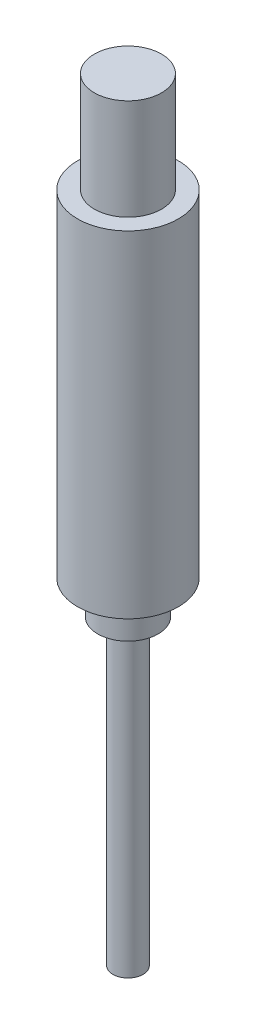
ISO-10303-21;
HEADER;
FILE_DESCRIPTION(('STEP AP214'),'2;1');
FILE_NAME('part.step','',(''),(''),'','','');
FILE_SCHEMA(('AUTOMOTIVE_DESIGN { 1 0 10303 214 1 1 1 1 }'));
ENDSEC;
DATA;
#1=APPLICATION_CONTEXT('core data for automotive mechanical design processes');
#2=APPLICATION_PROTOCOL_DEFINITION('international standard','automotive_design',2000,#1);
#3=PRODUCT_CONTEXT('',#1,'mechanical');
#4=PRODUCT('Part','Part','',(#3));
#5=PRODUCT_RELATED_PRODUCT_CATEGORY('part','',(#4));
#6=PRODUCT_DEFINITION_FORMATION('','',#4);
#7=PRODUCT_DEFINITION_CONTEXT('part definition',#1,'design');
#8=PRODUCT_DEFINITION('design','',#6,#7);
#9=PRODUCT_DEFINITION_SHAPE('','',#8);
#10=(LENGTH_UNIT() NAMED_UNIT(*) SI_UNIT(.MILLI.,.METRE.));
#11=(NAMED_UNIT(*) PLANE_ANGLE_UNIT() SI_UNIT($,.RADIAN.));
#12=(NAMED_UNIT(*) SI_UNIT($,.STERADIAN.) SOLID_ANGLE_UNIT());
#13=UNCERTAINTY_MEASURE_WITH_UNIT(LENGTH_MEASURE(1.E-05),#10,'distance_accuracy_value','');
#14=(GEOMETRIC_REPRESENTATION_CONTEXT(3) GLOBAL_UNCERTAINTY_ASSIGNED_CONTEXT((#13)) GLOBAL_UNIT_ASSIGNED_CONTEXT((#10,
#11,#12)) REPRESENTATION_CONTEXT('',''));
#15=CARTESIAN_POINT('',(0.,0.,0.));
#16=DIRECTION('',(0.,0.,1.));
#17=DIRECTION('',(1.,0.,0.));
#18=AXIS2_PLACEMENT_3D('',#15,#16,#17);
#19=CARTESIAN_POINT('',(-30.8921980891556,10.,-14.4906702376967));
#20=DIRECTION('',(0.,1.,0.));
#21=DIRECTION('',(0.,0.,1.));
#22=AXIS2_PLACEMENT_3D('',#19,#20,#21);
#23=PLANE('',#22);
#24=CARTESIAN_POINT('',(-30.8921980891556,10.,-14.4906702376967));
#25=DIRECTION('',(0.,1.,0.));
#26=DIRECTION('',(0.,0.,1.));
#27=AXIS2_PLACEMENT_3D('',#24,#25,#26);
#28=CIRCLE('',#27,1.5);
#29=CARTESIAN_POINT('',(-30.8921980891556,10.,-12.9906702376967));
#30=VERTEX_POINT('',#29);
#31=EDGE_CURVE('E29',#30,#30,#28,.T.);
#32=ORIENTED_EDGE('',*,*,#31,.F.);
#33=EDGE_LOOP('',(#32));
#34=FACE_BOUND('',#33,.T.);
#35=CARTESIAN_POINT('',(-30.8921980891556,10.,-14.4906702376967));
#36=DIRECTION('',(0.,1.,0.));
#37=DIRECTION('',(0.,0.,1.));
#38=AXIS2_PLACEMENT_3D('',#35,#36,#37);
#39=CIRCLE('',#38,0.9);
#40=CARTESIAN_POINT('',(-30.8921980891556,10.,-13.5906702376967));
#41=VERTEX_POINT('',#40);
#42=EDGE_CURVE('E10',#41,#41,#39,.F.);
#43=ORIENTED_EDGE('',*,*,#42,.F.);
#44=EDGE_LOOP('',(#43));
#45=FACE_BOUND('',#44,.T.);
#46=ADVANCED_FACE('F14',(#34,#45),#23,.F.);
#47=CARTESIAN_POINT('',(-30.8921980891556,20.,-14.4906702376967));
#48=DIRECTION('',(0.,1.,0.));
#49=DIRECTION('',(0.,0.,1.));
#50=AXIS2_PLACEMENT_3D('',#47,#48,#49);
#51=PLANE('',#50);
#52=CARTESIAN_POINT('',(-30.8921980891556,20.,-14.4906702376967));
#53=DIRECTION('',(0.,1.,0.));
#54=DIRECTION('',(0.,0.,1.));
#55=AXIS2_PLACEMENT_3D('',#52,#53,#54);
#56=CIRCLE('',#55,1.5);
#57=CARTESIAN_POINT('',(-30.8921980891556,20.,-12.9906702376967));
#58=VERTEX_POINT('',#57);
#59=EDGE_CURVE('E26',#58,#58,#56,.T.);
#60=ORIENTED_EDGE('',*,*,#59,.T.);
#61=EDGE_LOOP('',(#60));
#62=FACE_BOUND('',#61,.T.);
#63=CARTESIAN_POINT('',(-30.8921980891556,20.,-14.4906702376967));
#64=DIRECTION('',(0.,1.,0.));
#65=DIRECTION('',(0.,0.,1.));
#66=AXIS2_PLACEMENT_3D('',#63,#64,#65);
#67=CIRCLE('',#66,1.);
#68=CARTESIAN_POINT('',(-30.8921980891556,20.,-13.4906702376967));
#69=VERTEX_POINT('',#68);
#70=EDGE_CURVE('E35',#69,#69,#67,.T.);
#71=ORIENTED_EDGE('',*,*,#70,.F.);
#72=EDGE_LOOP('',(#71));
#73=FACE_BOUND('',#72,.T.);
#74=ADVANCED_FACE('F67',(#62,#73),#51,.T.);
#75=CARTESIAN_POINT('',(-30.8921980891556,20.,-14.4906702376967));
#76=DIRECTION('',(0.,-1.,0.));
#77=DIRECTION('',(0.,0.,-1.));
#78=AXIS2_PLACEMENT_3D('',#75,#76,#77);
#79=CYLINDRICAL_SURFACE('',#78,1.5);
#80=ORIENTED_EDGE('',*,*,#59,.F.);
#81=EDGE_LOOP('',(#80));
#82=FACE_BOUND('',#81,.T.);
#83=ORIENTED_EDGE('',*,*,#31,.T.);
#84=EDGE_LOOP('',(#83));
#85=FACE_BOUND('',#84,.T.);
#86=ADVANCED_FACE('F74',(#82,#85),#79,.T.);
#87=CARTESIAN_POINT('',(-30.8921980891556,23.,-14.4906702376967));
#88=DIRECTION('',(0.,-1.,0.));
#89=DIRECTION('',(0.,0.,-1.));
#90=AXIS2_PLACEMENT_3D('',#87,#88,#89);
#91=CYLINDRICAL_SURFACE('',#90,1.);
#92=CARTESIAN_POINT('',(-30.8921980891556,23.,-14.4906702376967));
#93=DIRECTION('',(0.,1.,0.));
#94=DIRECTION('',(0.,0.,1.));
#95=AXIS2_PLACEMENT_3D('',#92,#93,#94);
#96=CIRCLE('',#95,1.);
#97=CARTESIAN_POINT('',(-30.8921980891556,23.,-13.4906702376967));
#98=VERTEX_POINT('',#97);
#99=EDGE_CURVE('E32',#98,#98,#96,.T.);
#100=ORIENTED_EDGE('',*,*,#99,.F.);
#101=EDGE_LOOP('',(#100));
#102=FACE_BOUND('',#101,.T.);
#103=ORIENTED_EDGE('',*,*,#70,.T.);
#104=EDGE_LOOP('',(#103));
#105=FACE_BOUND('',#104,.T.);
#106=ADVANCED_FACE('F63',(#102,#105),#91,.T.);
#107=CARTESIAN_POINT('',(-30.8921980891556,23.,-14.4906702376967));
#108=DIRECTION('',(0.,1.,0.));
#109=DIRECTION('',(0.,0.,1.));
#110=AXIS2_PLACEMENT_3D('',#107,#108,#109);
#111=PLANE('',#110);
#112=ORIENTED_EDGE('',*,*,#99,.T.);
#113=EDGE_LOOP('',(#112));
#114=FACE_BOUND('',#113,.T.);
#115=ADVANCED_FACE('F52',(#114),#111,.T.);
#116=CARTESIAN_POINT('',(-30.8921980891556,9.,-14.4906702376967));
#117=DIRECTION('',(0.,-1.,0.));
#118=DIRECTION('',(0.,0.,-1.));
#119=AXIS2_PLACEMENT_3D('',#116,#117,#118);
#120=PLANE('',#119);
#121=CARTESIAN_POINT('',(-30.8921980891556,9.,-14.4906702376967));
#122=DIRECTION('',(0.,-1.,0.));
#123=DIRECTION('',(0.,0.,-1.));
#124=AXIS2_PLACEMENT_3D('',#121,#122,#123);
#125=CIRCLE('',#124,0.9);
#126=CARTESIAN_POINT('',(-30.8921980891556,9.,-15.3906702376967));
#127=VERTEX_POINT('',#126);
#128=EDGE_CURVE('E40',#127,#127,#125,.T.);
#129=ORIENTED_EDGE('',*,*,#128,.T.);
#130=EDGE_LOOP('',(#129));
#131=FACE_BOUND('',#130,.T.);
#132=CARTESIAN_POINT('',(-30.8921980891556,9.,-14.4906702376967));
#133=DIRECTION('',(0.,-1.,0.));
#134=DIRECTION('',(0.,0.,-1.));
#135=AXIS2_PLACEMENT_3D('',#132,#133,#134);
#136=CIRCLE('',#135,0.45);
#137=CARTESIAN_POINT('',(-30.8921980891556,9.,-14.9406702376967));
#138=VERTEX_POINT('',#137);
#139=EDGE_CURVE('E18',#138,#138,#136,.T.);
#140=ORIENTED_EDGE('',*,*,#139,.F.);
#141=EDGE_LOOP('',(#140));
#142=FACE_BOUND('',#141,.T.);
#143=ADVANCED_FACE('F49',(#131,#142),#120,.T.);
#144=CARTESIAN_POINT('',(-30.8921980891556,9.,-14.4906702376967));
#145=DIRECTION('',(0.,1.,0.));
#146=DIRECTION('',(0.,0.,1.));
#147=AXIS2_PLACEMENT_3D('',#144,#145,#146);
#148=CYLINDRICAL_SURFACE('',#147,0.9);
#149=ORIENTED_EDGE('',*,*,#128,.F.);
#150=EDGE_LOOP('',(#149));
#151=FACE_BOUND('',#150,.T.);
#152=ORIENTED_EDGE('',*,*,#42,.T.);
#153=EDGE_LOOP('',(#152));
#154=FACE_BOUND('',#153,.T.);
#155=ADVANCED_FACE('F51',(#151,#154),#148,.T.);
#156=CARTESIAN_POINT('',(-30.8921980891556,0.,-14.4906702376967));
#157=DIRECTION('',(0.,1.,0.));
#158=DIRECTION('',(0.,0.,1.));
#159=AXIS2_PLACEMENT_3D('',#156,#157,#158);
#160=PLANE('',#159);
#161=CARTESIAN_POINT('',(-30.8921980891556,0.,-14.4906702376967));
#162=DIRECTION('',(0.,1.,0.));
#163=DIRECTION('',(0.,0.,1.));
#164=AXIS2_PLACEMENT_3D('',#161,#162,#163);
#165=CIRCLE('',#164,0.45);
#166=CARTESIAN_POINT('',(-30.8921980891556,0.,-14.0406702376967));
#167=VERTEX_POINT('',#166);
#168=EDGE_CURVE('E22',#167,#167,#165,.T.);
#169=ORIENTED_EDGE('',*,*,#168,.F.);
#170=EDGE_LOOP('',(#169));
#171=FACE_BOUND('',#170,.T.);
#172=ADVANCED_FACE('F60',(#171),#160,.F.);
#173=CARTESIAN_POINT('',(-30.8921980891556,10.,-14.4906702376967));
#174=DIRECTION('',(0.,-1.,0.));
#175=DIRECTION('',(0.,0.,-1.));
#176=AXIS2_PLACEMENT_3D('',#173,#174,#175);
#177=CYLINDRICAL_SURFACE('',#176,0.45);
#178=ORIENTED_EDGE('',*,*,#139,.T.);
#179=EDGE_LOOP('',(#178));
#180=FACE_BOUND('',#179,.T.);
#181=ORIENTED_EDGE('',*,*,#168,.T.);
#182=EDGE_LOOP('',(#181));
#183=FACE_BOUND('',#182,.T.);
#184=ADVANCED_FACE('F16',(#180,#183),#177,.T.);
#185=CLOSED_SHELL('',(#46,#74,#86,#106,#115,#143,#155,#172,#184));
#186=MANIFOLD_SOLID_BREP('B1',#185);
#187=ADVANCED_BREP_SHAPE_REPRESENTATION('',(#18,#186),#14);
#188=SHAPE_DEFINITION_REPRESENTATION(#9,#187);
ENDSEC;
END-ISO-10303-21;
